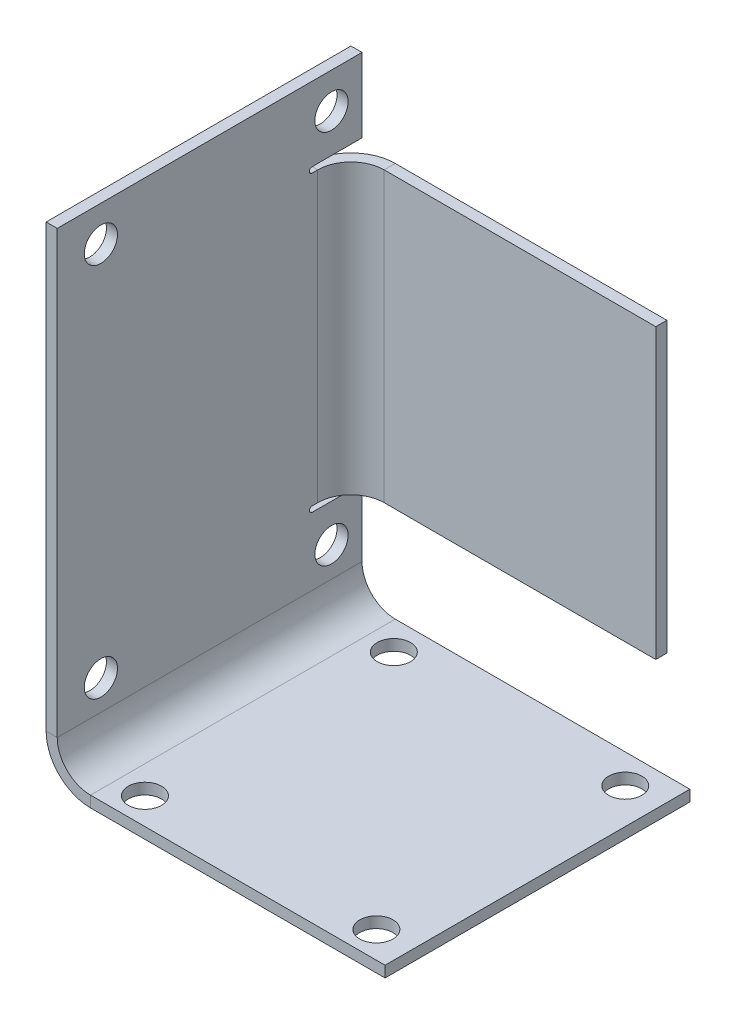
ISO-10303-21;
HEADER;
FILE_DESCRIPTION(('STEP AP214'),'2;1');
FILE_NAME('part.step','',(''),(''),'','','');
FILE_SCHEMA(('AUTOMOTIVE_DESIGN { 1 0 10303 214 1 1 1 1 }'));
ENDSEC;
DATA;
#1=APPLICATION_CONTEXT('core data for automotive mechanical design processes');
#2=APPLICATION_PROTOCOL_DEFINITION('international standard','automotive_design',2000,#1);
#3=PRODUCT_CONTEXT('',#1,'mechanical');
#4=PRODUCT('Part','Part','',(#3));
#5=PRODUCT_RELATED_PRODUCT_CATEGORY('part','',(#4));
#6=PRODUCT_DEFINITION_FORMATION('','',#4);
#7=PRODUCT_DEFINITION_CONTEXT('part definition',#1,'design');
#8=PRODUCT_DEFINITION('design','',#6,#7);
#9=PRODUCT_DEFINITION_SHAPE('','',#8);
#10=(LENGTH_UNIT() NAMED_UNIT(*) SI_UNIT(.MILLI.,.METRE.));
#11=(NAMED_UNIT(*) PLANE_ANGLE_UNIT() SI_UNIT($,.RADIAN.));
#12=(NAMED_UNIT(*) SI_UNIT($,.STERADIAN.) SOLID_ANGLE_UNIT());
#13=UNCERTAINTY_MEASURE_WITH_UNIT(LENGTH_MEASURE(1.E-05),#10,'distance_accuracy_value','');
#14=(GEOMETRIC_REPRESENTATION_CONTEXT(3) GLOBAL_UNCERTAINTY_ASSIGNED_CONTEXT((#13)) GLOBAL_UNIT_ASSIGNED_CONTEXT((#10,
#11,#12)) REPRESENTATION_CONTEXT('',''));
#15=CARTESIAN_POINT('',(0.,0.,0.));
#16=DIRECTION('',(0.,0.,1.));
#17=DIRECTION('',(1.,0.,0.));
#18=AXIS2_PLACEMENT_3D('',#15,#16,#17);
#19=CARTESIAN_POINT('',(0.,85.5607180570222,55.));
#20=DIRECTION('',(1.,0.,0.));
#21=DIRECTION('',(0.,0.,-1.));
#22=AXIS2_PLACEMENT_3D('',#19,#20,#21);
#23=PLANE('',#22);
#24=CARTESIAN_POINT('',(0.,11.3845694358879,47.1202330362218));
#25=DIRECTION('',(1.,0.,0.));
#26=DIRECTION('',(0.,0.,-1.));
#27=AXIS2_PLACEMENT_3D('',#24,#25,#26);
#28=CIRCLE('',#27,3.);
#29=CARTESIAN_POINT('',(0.,11.3845694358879,44.1202330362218));
#30=VERTEX_POINT('',#29);
#31=EDGE_CURVE('E897',#30,#30,#28,.T.);
#32=ORIENTED_EDGE('',*,*,#31,.F.);
#33=EDGE_LOOP('',(#32));
#34=FACE_BOUND('',#33,.T.);
#35=CARTESIAN_POINT('',(0.,79.1522314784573,5.51288170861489));
#36=DIRECTION('',(1.,0.,0.));
#37=DIRECTION('',(0.,0.,-1.));
#38=AXIS2_PLACEMENT_3D('',#35,#36,#37);
#39=CIRCLE('',#38,3.);
#40=CARTESIAN_POINT('',(0.,79.1522314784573,2.51288170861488));
#41=VERTEX_POINT('',#40);
#42=EDGE_CURVE('E237',#41,#41,#39,.T.);
#43=ORIENTED_EDGE('',*,*,#42,.F.);
#44=EDGE_LOOP('',(#43));
#45=FACE_BOUND('',#44,.T.);
#46=DIRECTION('',(0.,0.,-1.));
#47=VECTOR('',#46,1.);
#48=CARTESIAN_POINT('',(0.,19.1920091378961,55.));
#49=LINE('',#48,#47);
#50=CARTESIAN_POINT('',(0.,19.1920091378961,8.99999999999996));
#51=VERTEX_POINT('',#50);
#52=CARTESIAN_POINT('',(0.,19.192009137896,8.));
#53=VERTEX_POINT('',#52);
#54=EDGE_CURVE('E296',#51,#53,#49,.T.);
#55=ORIENTED_EDGE('',*,*,#54,.T.);
#56=DIRECTION('',(0.,1.,0.));
#57=VECTOR('',#56,1.);
#58=CARTESIAN_POINT('',(0.,19.1920091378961,8.));
#59=LINE('',#58,#57);
#60=CARTESIAN_POINT('',(0.,71.2035560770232,8.));
#61=VERTEX_POINT('',#60);
#62=EDGE_CURVE('E304',#53,#61,#59,.T.);
#63=ORIENTED_EDGE('',*,*,#62,.T.);
#64=DIRECTION('',(0.,0.,1.));
#65=VECTOR('',#64,1.);
#66=CARTESIAN_POINT('',(0.,71.2035560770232,55.));
#67=LINE('',#66,#65);
#68=CARTESIAN_POINT('',(0.,71.2035560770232,8.99999999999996));
#69=VERTEX_POINT('',#68);
#70=EDGE_CURVE('E299',#61,#69,#67,.T.);
#71=ORIENTED_EDGE('',*,*,#70,.T.);
#72=CARTESIAN_POINT('',(0.,71.7035560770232,8.99999999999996));
#73=DIRECTION('',(1.,0.,0.));
#74=DIRECTION('',(0.,0.,-1.));
#75=AXIS2_PLACEMENT_3D('',#72,#73,#74);
#76=CIRCLE('',#75,0.5);
#77=CARTESIAN_POINT('',(0.,72.2035560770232,8.99999999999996));
#78=VERTEX_POINT('',#77);
#79=EDGE_CURVE('E276',#78,#69,#76,.T.);
#80=ORIENTED_EDGE('',*,*,#79,.F.);
#81=DIRECTION('',(0.,0.,-1.));
#82=VECTOR('',#81,1.);
#83=CARTESIAN_POINT('',(0.,72.2035560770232,55.));
#84=LINE('',#83,#82);
#85=CARTESIAN_POINT('',(0.,72.2035560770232,0.));
#86=VERTEX_POINT('',#85);
#87=EDGE_CURVE('E279',#78,#86,#84,.T.);
#88=ORIENTED_EDGE('',*,*,#87,.T.);
#89=DIRECTION('',(0.,-1.,0.));
#90=VECTOR('',#89,1.);
#91=CARTESIAN_POINT('',(0.,85.5607180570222,0.));
#92=LINE('',#91,#90);
#93=CARTESIAN_POINT('',(0.,85.5607180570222,0.));
#94=VERTEX_POINT('',#93);
#95=EDGE_CURVE('E281',#94,#86,#92,.T.);
#96=ORIENTED_EDGE('',*,*,#95,.F.);
#97=DIRECTION('',(0.,0.,-1.));
#98=VECTOR('',#97,1.);
#99=CARTESIAN_POINT('',(0.,85.5607180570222,55.));
#100=LINE('',#99,#98);
#101=CARTESIAN_POINT('',(0.,85.5607180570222,55.));
#102=VERTEX_POINT('',#101);
#103=EDGE_CURVE('E284',#102,#94,#100,.T.);
#104=ORIENTED_EDGE('',*,*,#103,.F.);
#105=DIRECTION('',(0.,-1.,0.));
#106=VECTOR('',#105,1.);
#107=CARTESIAN_POINT('',(0.,85.5607180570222,55.));
#108=LINE('',#107,#106);
#109=CARTESIAN_POINT('',(0.,6.00000000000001,55.));
#110=VERTEX_POINT('',#109);
#111=EDGE_CURVE('E288',#102,#110,#108,.T.);
#112=ORIENTED_EDGE('',*,*,#111,.T.);
#113=DIRECTION('',(0.,0.,-1.));
#114=VECTOR('',#113,1.);
#115=CARTESIAN_POINT('',(0.,6.,55.));
#116=LINE('',#115,#114);
#117=CARTESIAN_POINT('',(0.,6.,0.));
#118=VERTEX_POINT('',#117);
#119=EDGE_CURVE('E301',#110,#118,#116,.T.);
#120=ORIENTED_EDGE('',*,*,#119,.T.);
#121=CARTESIAN_POINT('',(0.,18.1920091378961,0.));
#122=VERTEX_POINT('',#121);
#123=EDGE_CURVE('E285',#122,#118,#92,.T.);
#124=ORIENTED_EDGE('',*,*,#123,.F.);
#125=DIRECTION('',(0.,0.,1.));
#126=VECTOR('',#125,1.);
#127=CARTESIAN_POINT('',(0.,18.1920091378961,55.));
#128=LINE('',#127,#126);
#129=CARTESIAN_POINT('',(0.,18.1920091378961,8.99999999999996));
#130=VERTEX_POINT('',#129);
#131=EDGE_CURVE('E291',#122,#130,#128,.T.);
#132=ORIENTED_EDGE('',*,*,#131,.T.);
#133=CARTESIAN_POINT('',(0.,18.6920091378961,8.99999999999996));
#134=DIRECTION('',(1.,0.,0.));
#135=DIRECTION('',(0.,0.,-1.));
#136=AXIS2_PLACEMENT_3D('',#133,#134,#135);
#137=CIRCLE('',#136,0.5);
#138=EDGE_CURVE('E293',#51,#130,#137,.T.);
#139=ORIENTED_EDGE('',*,*,#138,.F.);
#140=EDGE_LOOP('',(#55,#63,#71,#80,#88,#96,#104,#112,#120,#124,#132,#139));
#141=FACE_BOUND('',#140,.T.);
#142=CARTESIAN_POINT('',(0.,79.1522314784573,47.1202330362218));
#143=DIRECTION('',(1.,0.,0.));
#144=DIRECTION('',(0.,0.,-1.));
#145=AXIS2_PLACEMENT_3D('',#142,#143,#144);
#146=CIRCLE('',#145,3.);
#147=CARTESIAN_POINT('',(0.,79.1522314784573,44.1202330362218));
#148=VERTEX_POINT('',#147);
#149=EDGE_CURVE('E902',#148,#148,#146,.T.);
#150=ORIENTED_EDGE('',*,*,#149,.F.);
#151=EDGE_LOOP('',(#150));
#152=FACE_BOUND('',#151,.T.);
#153=CARTESIAN_POINT('',(0.,11.3845694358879,5.51288170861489));
#154=DIRECTION('',(1.,0.,0.));
#155=DIRECTION('',(0.,0.,-1.));
#156=AXIS2_PLACEMENT_3D('',#153,#154,#155);
#157=CIRCLE('',#156,3.);
#158=CARTESIAN_POINT('',(0.,11.3845694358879,2.51288170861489));
#159=VERTEX_POINT('',#158);
#160=EDGE_CURVE('E886',#159,#159,#157,.T.);
#161=ORIENTED_EDGE('',*,*,#160,.F.);
#162=EDGE_LOOP('',(#161));
#163=FACE_BOUND('',#162,.T.);
#164=ADVANCED_FACE('F32',(#34,#45,#141,#152,#163),#23,.T.);
#165=CARTESIAN_POINT('',(-2.,85.5607180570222,55.));
#166=DIRECTION('',(1.,0.,0.));
#167=DIRECTION('',(0.,0.,-1.));
#168=AXIS2_PLACEMENT_3D('',#165,#166,#167);
#169=PLANE('',#168);
#170=CARTESIAN_POINT('',(-2.,11.3845694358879,47.1202330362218));
#171=DIRECTION('',(1.,0.,0.));
#172=DIRECTION('',(0.,0.,-1.));
#173=AXIS2_PLACEMENT_3D('',#170,#171,#172);
#174=CIRCLE('',#173,3.);
#175=CARTESIAN_POINT('',(-2.,11.3845694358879,44.1202330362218));
#176=VERTEX_POINT('',#175);
#177=EDGE_CURVE('E899',#176,#176,#174,.T.);
#178=ORIENTED_EDGE('',*,*,#177,.T.);
#179=EDGE_LOOP('',(#178));
#180=FACE_BOUND('',#179,.T.);
#181=CARTESIAN_POINT('',(-2.,79.1522314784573,5.51288170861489));
#182=DIRECTION('',(1.,0.,0.));
#183=DIRECTION('',(0.,0.,-1.));
#184=AXIS2_PLACEMENT_3D('',#181,#182,#183);
#185=CIRCLE('',#184,3.);
#186=CARTESIAN_POINT('',(-2.,79.1522314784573,2.51288170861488));
#187=VERTEX_POINT('',#186);
#188=EDGE_CURVE('E240',#187,#187,#185,.T.);
#189=ORIENTED_EDGE('',*,*,#188,.T.);
#190=EDGE_LOOP('',(#189));
#191=FACE_BOUND('',#190,.T.);
#192=DIRECTION('',(0.,1.,0.));
#193=VECTOR('',#192,1.);
#194=CARTESIAN_POINT('',(-2.,19.1920091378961,8.));
#195=LINE('',#194,#193);
#196=CARTESIAN_POINT('',(-2.,19.192009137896,8.));
#197=VERTEX_POINT('',#196);
#198=CARTESIAN_POINT('',(-2.,71.2035560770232,8.));
#199=VERTEX_POINT('',#198);
#200=EDGE_CURVE('E274',#197,#199,#195,.T.);
#201=ORIENTED_EDGE('',*,*,#200,.F.);
#202=DIRECTION('',(0.,0.,-1.));
#203=VECTOR('',#202,1.);
#204=CARTESIAN_POINT('',(-2.,19.1920091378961,55.));
#205=LINE('',#204,#203);
#206=CARTESIAN_POINT('',(-2.,19.1920091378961,8.99999999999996));
#207=VERTEX_POINT('',#206);
#208=EDGE_CURVE('E254',#207,#197,#205,.T.);
#209=ORIENTED_EDGE('',*,*,#208,.F.);
#210=CARTESIAN_POINT('',(-2.,18.6920091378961,8.99999999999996));
#211=DIRECTION('',(1.,0.,0.));
#212=DIRECTION('',(0.,0.,-1.));
#213=AXIS2_PLACEMENT_3D('',#210,#211,#212);
#214=CIRCLE('',#213,0.5);
#215=CARTESIAN_POINT('',(-2.,18.1920091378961,8.99999999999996));
#216=VERTEX_POINT('',#215);
#217=EDGE_CURVE('E262',#207,#216,#214,.T.);
#218=ORIENTED_EDGE('',*,*,#217,.T.);
#219=DIRECTION('',(0.,0.,1.));
#220=VECTOR('',#219,1.);
#221=CARTESIAN_POINT('',(-2.,18.1920091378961,55.));
#222=LINE('',#221,#220);
#223=CARTESIAN_POINT('',(-2.,18.1920091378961,0.));
#224=VERTEX_POINT('',#223);
#225=EDGE_CURVE('E265',#224,#216,#222,.T.);
#226=ORIENTED_EDGE('',*,*,#225,.F.);
#227=DIRECTION('',(0.,1.,0.));
#228=VECTOR('',#227,1.);
#229=CARTESIAN_POINT('',(-2.,85.5607180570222,0.));
#230=LINE('',#229,#228);
#231=CARTESIAN_POINT('',(-2.,6.00000000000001,0.));
#232=VERTEX_POINT('',#231);
#233=EDGE_CURVE('E260',#224,#232,#230,.F.);
#234=ORIENTED_EDGE('',*,*,#233,.T.);
#235=DIRECTION('',(0.,0.,-1.));
#236=VECTOR('',#235,1.);
#237=CARTESIAN_POINT('',(-2.,6.,55.));
#238=LINE('',#237,#236);
#239=CARTESIAN_POINT('',(-2.,6.00000000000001,55.));
#240=VERTEX_POINT('',#239);
#241=EDGE_CURVE('E258',#240,#232,#238,.T.);
#242=ORIENTED_EDGE('',*,*,#241,.F.);
#243=DIRECTION('',(0.,1.,0.));
#244=VECTOR('',#243,1.);
#245=CARTESIAN_POINT('',(-2.,85.5607180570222,55.));
#246=LINE('',#245,#244);
#247=CARTESIAN_POINT('',(-2.,85.5607180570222,55.));
#248=VERTEX_POINT('',#247);
#249=EDGE_CURVE('E268',#248,#240,#246,.F.);
#250=ORIENTED_EDGE('',*,*,#249,.F.);
#251=DIRECTION('',(0.,0.,-1.));
#252=VECTOR('',#251,1.);
#253=CARTESIAN_POINT('',(-2.,85.5607180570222,55.));
#254=LINE('',#253,#252);
#255=CARTESIAN_POINT('',(-2.,85.5607180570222,0.));
#256=VERTEX_POINT('',#255);
#257=EDGE_CURVE('E259',#248,#256,#254,.T.);
#258=ORIENTED_EDGE('',*,*,#257,.T.);
#259=CARTESIAN_POINT('',(-2.,72.2035560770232,0.));
#260=VERTEX_POINT('',#259);
#261=EDGE_CURVE('E255',#256,#260,#230,.F.);
#262=ORIENTED_EDGE('',*,*,#261,.T.);
#263=DIRECTION('',(0.,0.,-1.));
#264=VECTOR('',#263,1.);
#265=CARTESIAN_POINT('',(-2.,72.2035560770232,55.));
#266=LINE('',#265,#264);
#267=CARTESIAN_POINT('',(-2.,72.2035560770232,8.99999999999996));
#268=VERTEX_POINT('',#267);
#269=EDGE_CURVE('E247',#268,#260,#266,.T.);
#270=ORIENTED_EDGE('',*,*,#269,.F.);
#271=CARTESIAN_POINT('',(-2.,71.7035560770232,8.99999999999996));
#272=DIRECTION('',(1.,0.,0.));
#273=DIRECTION('',(0.,0.,-1.));
#274=AXIS2_PLACEMENT_3D('',#271,#272,#273);
#275=CIRCLE('',#274,0.5);
#276=CARTESIAN_POINT('',(-2.,71.2035560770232,8.99999999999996));
#277=VERTEX_POINT('',#276);
#278=EDGE_CURVE('E115',#268,#277,#275,.T.);
#279=ORIENTED_EDGE('',*,*,#278,.T.);
#280=DIRECTION('',(0.,0.,1.));
#281=VECTOR('',#280,1.);
#282=CARTESIAN_POINT('',(-2.,71.2035560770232,55.));
#283=LINE('',#282,#281);
#284=EDGE_CURVE('E108',#199,#277,#283,.T.);
#285=ORIENTED_EDGE('',*,*,#284,.F.);
#286=EDGE_LOOP('',(#201,#209,#218,#226,#234,#242,#250,#258,#262,#270,#279,#285));
#287=FACE_BOUND('',#286,.T.);
#288=CARTESIAN_POINT('',(-2.,79.1522314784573,47.1202330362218));
#289=DIRECTION('',(1.,0.,0.));
#290=DIRECTION('',(0.,0.,-1.));
#291=AXIS2_PLACEMENT_3D('',#288,#289,#290);
#292=CIRCLE('',#291,3.);
#293=CARTESIAN_POINT('',(-2.,79.1522314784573,44.1202330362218));
#294=VERTEX_POINT('',#293);
#295=EDGE_CURVE('E905',#294,#294,#292,.T.);
#296=ORIENTED_EDGE('',*,*,#295,.T.);
#297=EDGE_LOOP('',(#296));
#298=FACE_BOUND('',#297,.T.);
#299=CARTESIAN_POINT('',(-2.,11.3845694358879,5.51288170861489));
#300=DIRECTION('',(1.,0.,0.));
#301=DIRECTION('',(0.,0.,-1.));
#302=AXIS2_PLACEMENT_3D('',#299,#300,#301);
#303=CIRCLE('',#302,3.);
#304=CARTESIAN_POINT('',(-2.,11.3845694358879,2.51288170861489));
#305=VERTEX_POINT('',#304);
#306=EDGE_CURVE('E890',#305,#305,#303,.T.);
#307=ORIENTED_EDGE('',*,*,#306,.T.);
#308=EDGE_LOOP('',(#307));
#309=FACE_BOUND('',#308,.T.);
#310=ADVANCED_FACE('F391',(#180,#191,#287,#298,#309),#169,.F.);
#311=CARTESIAN_POINT('',(55.,71.2035560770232,144.915373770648));
#312=DIRECTION('',(1.,0.,0.));
#313=DIRECTION('',(0.,0.,-1.));
#314=AXIS2_PLACEMENT_3D('',#311,#312,#313);
#315=PLANE('',#314);
#316=DIRECTION('',(0.,0.,-1.));
#317=VECTOR('',#316,1.);
#318=CARTESIAN_POINT('',(55.,19.1920091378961,144.915373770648));
#319=LINE('',#318,#317);
#320=CARTESIAN_POINT('',(55.,19.1920091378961,2.));
#321=VERTEX_POINT('',#320);
#322=CARTESIAN_POINT('',(55.,19.1920091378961,0.));
#323=VERTEX_POINT('',#322);
#324=EDGE_CURVE('E225',#321,#323,#319,.T.);
#325=ORIENTED_EDGE('',*,*,#324,.T.);
#326=DIRECTION('',(0.,-1.,0.));
#327=VECTOR('',#326,1.);
#328=CARTESIAN_POINT('',(55.,71.2035560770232,0.));
#329=LINE('',#328,#327);
#330=CARTESIAN_POINT('',(55.,71.2035560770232,0.));
#331=VERTEX_POINT('',#330);
#332=EDGE_CURVE('E203',#331,#323,#329,.T.);
#333=ORIENTED_EDGE('',*,*,#332,.F.);
#334=DIRECTION('',(0.,0.,-1.));
#335=VECTOR('',#334,1.);
#336=CARTESIAN_POINT('',(55.,71.2035560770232,144.915373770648));
#337=LINE('',#336,#335);
#338=CARTESIAN_POINT('',(55.,71.2035560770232,2.));
#339=VERTEX_POINT('',#338);
#340=EDGE_CURVE('E362',#339,#331,#337,.T.);
#341=ORIENTED_EDGE('',*,*,#340,.F.);
#342=DIRECTION('',(0.,1.,0.));
#343=VECTOR('',#342,1.);
#344=CARTESIAN_POINT('',(55.,71.2035560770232,2.));
#345=LINE('',#344,#343);
#346=EDGE_CURVE('E51',#339,#321,#345,.F.);
#347=ORIENTED_EDGE('',*,*,#346,.T.);
#348=EDGE_LOOP('',(#325,#333,#341,#347));
#349=FACE_BOUND('',#348,.T.);
#350=ADVANCED_FACE('F369',(#349),#315,.T.);
#351=CARTESIAN_POINT('',(55.,19.1920091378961,144.915373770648));
#352=DIRECTION('',(0.,-1.,0.));
#353=DIRECTION('',(1.,0.,0.));
#354=AXIS2_PLACEMENT_3D('',#351,#352,#353);
#355=PLANE('',#354);
#356=DIRECTION('',(0.,0.,-1.));
#357=VECTOR('',#356,1.);
#358=CARTESIAN_POINT('',(6.,19.1920091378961,144.915373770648));
#359=LINE('',#358,#357);
#360=CARTESIAN_POINT('',(5.99999999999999,19.1920091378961,2.));
#361=VERTEX_POINT('',#360);
#362=CARTESIAN_POINT('',(6.,19.192009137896,0.));
#363=VERTEX_POINT('',#362);
#364=EDGE_CURVE('E210',#361,#363,#359,.T.);
#365=ORIENTED_EDGE('',*,*,#364,.T.);
#366=DIRECTION('',(-1.,0.,0.));
#367=VECTOR('',#366,1.);
#368=CARTESIAN_POINT('',(55.,19.1920091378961,0.));
#369=LINE('',#368,#367);
#370=EDGE_CURVE('E195',#323,#363,#369,.T.);
#371=ORIENTED_EDGE('',*,*,#370,.F.);
#372=ORIENTED_EDGE('',*,*,#324,.F.);
#373=DIRECTION('',(-1.,0.,0.));
#374=VECTOR('',#373,1.);
#375=CARTESIAN_POINT('',(55.,19.1920091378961,2.));
#376=LINE('',#375,#374);
#377=EDGE_CURVE('E212',#321,#361,#376,.T.);
#378=ORIENTED_EDGE('',*,*,#377,.T.);
#379=EDGE_LOOP('',(#365,#371,#372,#378));
#380=FACE_BOUND('',#379,.T.);
#381=ADVANCED_FACE('F211',(#380),#355,.T.);
#382=CARTESIAN_POINT('',(59.1549102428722,-2.,0.));
#383=DIRECTION('',(0.,0.,-1.));
#384=DIRECTION('',(-1.,0.,0.));
#385=AXIS2_PLACEMENT_3D('',#382,#383,#384);
#386=PLANE('',#385);
#387=DIRECTION('',(0.,-1.,0.));
#388=VECTOR('',#387,1.);
#389=CARTESIAN_POINT('',(6.,19.1920091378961,0.));
#390=LINE('',#389,#388);
#391=CARTESIAN_POINT('',(6.,71.2035560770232,0.));
#392=VERTEX_POINT('',#391);
#393=EDGE_CURVE('E200',#392,#363,#390,.T.);
#394=ORIENTED_EDGE('',*,*,#393,.F.);
#395=DIRECTION('',(-1.,0.,0.));
#396=VECTOR('',#395,1.);
#397=CARTESIAN_POINT('',(55.,71.2035560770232,0.));
#398=LINE('',#397,#396);
#399=EDGE_CURVE('E207',#331,#392,#398,.T.);
#400=ORIENTED_EDGE('',*,*,#399,.F.);
#401=ORIENTED_EDGE('',*,*,#332,.T.);
#402=ORIENTED_EDGE('',*,*,#370,.T.);
#403=EDGE_LOOP('',(#394,#400,#401,#402));
#404=FACE_BOUND('',#403,.T.);
#405=ADVANCED_FACE('F197',(#404),#386,.T.);
#406=CARTESIAN_POINT('',(55.,71.2035560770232,144.915373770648));
#407=DIRECTION('',(0.,-1.,0.));
#408=DIRECTION('',(1.,0.,0.));
#409=AXIS2_PLACEMENT_3D('',#406,#407,#408);
#410=PLANE('',#409);
#411=ORIENTED_EDGE('',*,*,#399,.T.);
#412=DIRECTION('',(0.,0.,-1.));
#413=VECTOR('',#412,1.);
#414=CARTESIAN_POINT('',(6.,71.2035560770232,144.915373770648));
#415=LINE('',#414,#413);
#416=CARTESIAN_POINT('',(6.,71.2035560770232,2.));
#417=VERTEX_POINT('',#416);
#418=EDGE_CURVE('E36',#417,#392,#415,.T.);
#419=ORIENTED_EDGE('',*,*,#418,.F.);
#420=DIRECTION('',(-1.,0.,0.));
#421=VECTOR('',#420,1.);
#422=CARTESIAN_POINT('',(55.,71.2035560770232,2.));
#423=LINE('',#422,#421);
#424=EDGE_CURVE('E42',#339,#417,#423,.T.);
#425=ORIENTED_EDGE('',*,*,#424,.F.);
#426=ORIENTED_EDGE('',*,*,#340,.T.);
#427=EDGE_LOOP('',(#411,#419,#425,#426));
#428=FACE_BOUND('',#427,.T.);
#429=ADVANCED_FACE('F372',(#428),#410,.F.);
#430=CARTESIAN_POINT('',(55.,71.2035560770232,2.));
#431=DIRECTION('',(0.,0.,-1.));
#432=DIRECTION('',(-1.,0.,0.));
#433=AXIS2_PLACEMENT_3D('',#430,#431,#432);
#434=PLANE('',#433);
#435=ORIENTED_EDGE('',*,*,#424,.T.);
#436=DIRECTION('',(0.,-1.,0.));
#437=VECTOR('',#436,1.);
#438=CARTESIAN_POINT('',(6.,19.1920091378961,2.));
#439=LINE('',#438,#437);
#440=EDGE_CURVE('E11',#417,#361,#439,.T.);
#441=ORIENTED_EDGE('',*,*,#440,.T.);
#442=ORIENTED_EDGE('',*,*,#377,.F.);
#443=ORIENTED_EDGE('',*,*,#346,.F.);
#444=EDGE_LOOP('',(#435,#441,#442,#443));
#445=FACE_BOUND('',#444,.T.);
#446=ADVANCED_FACE('F34',(#445),#434,.F.);
#447=CARTESIAN_POINT('',(59.1549102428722,152.976396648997,55.));
#448=DIRECTION('',(-1.,0.,0.));
#449=DIRECTION('',(0.,-1.,0.));
#450=AXIS2_PLACEMENT_3D('',#447,#448,#449);
#451=PLANE('',#450);
#452=DIRECTION('',(0.,-1.,0.));
#453=VECTOR('',#452,1.);
#454=CARTESIAN_POINT('',(59.1549102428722,152.976396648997,55.));
#455=LINE('',#454,#453);
#456=CARTESIAN_POINT('',(59.1549102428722,0.,55.));
#457=VERTEX_POINT('',#456);
#458=CARTESIAN_POINT('',(59.1549102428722,-2.,55.));
#459=VERTEX_POINT('',#458);
#460=EDGE_CURVE('E356',#457,#459,#455,.T.);
#461=ORIENTED_EDGE('',*,*,#460,.T.);
#462=DIRECTION('',(0.,0.,-1.));
#463=VECTOR('',#462,1.);
#464=CARTESIAN_POINT('',(59.1549102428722,-2.,55.));
#465=LINE('',#464,#463);
#466=CARTESIAN_POINT('',(59.1549102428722,-2.,0.));
#467=VERTEX_POINT('',#466);
#468=EDGE_CURVE('E353',#459,#467,#465,.T.);
#469=ORIENTED_EDGE('',*,*,#468,.T.);
#470=DIRECTION('',(0.,-1.,0.));
#471=VECTOR('',#470,1.);
#472=CARTESIAN_POINT('',(59.1549102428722,152.976396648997,0.));
#473=LINE('',#472,#471);
#474=CARTESIAN_POINT('',(59.1549102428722,0.,0.));
#475=VERTEX_POINT('',#474);
#476=EDGE_CURVE('E340',#475,#467,#473,.T.);
#477=ORIENTED_EDGE('',*,*,#476,.F.);
#478=DIRECTION('',(0.,0.,-1.));
#479=VECTOR('',#478,1.);
#480=CARTESIAN_POINT('',(59.1549102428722,0.,55.));
#481=LINE('',#480,#479);
#482=EDGE_CURVE('E78',#457,#475,#481,.T.);
#483=ORIENTED_EDGE('',*,*,#482,.F.);
#484=EDGE_LOOP('',(#461,#469,#477,#483));
#485=FACE_BOUND('',#484,.T.);
#486=ADVANCED_FACE('F420',(#485),#451,.F.);
#487=CARTESIAN_POINT('',(0.,152.976396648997,55.));
#488=DIRECTION('',(0.,0.,-1.));
#489=DIRECTION('',(0.,-1.,0.));
#490=AXIS2_PLACEMENT_3D('',#487,#488,#489);
#491=PLANE('',#490);
#492=DIRECTION('',(0.,-1.,0.));
#493=VECTOR('',#492,1.);
#494=CARTESIAN_POINT('',(6.,152.976396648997,55.));
#495=LINE('',#494,#493);
#496=CARTESIAN_POINT('',(6.,0.,55.));
#497=VERTEX_POINT('',#496);
#498=CARTESIAN_POINT('',(5.99999999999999,-2.,55.));
#499=VERTEX_POINT('',#498);
#500=EDGE_CURVE('E351',#497,#499,#495,.T.);
#501=ORIENTED_EDGE('',*,*,#500,.T.);
#502=DIRECTION('',(1.,0.,0.));
#503=VECTOR('',#502,1.);
#504=CARTESIAN_POINT('',(0.,-2.,55.));
#505=LINE('',#504,#503);
#506=EDGE_CURVE('E100',#499,#459,#505,.T.);
#507=ORIENTED_EDGE('',*,*,#506,.T.);
#508=ORIENTED_EDGE('',*,*,#460,.F.);
#509=DIRECTION('',(1.,0.,0.));
#510=VECTOR('',#509,1.);
#511=CARTESIAN_POINT('',(0.,0.,55.));
#512=LINE('',#511,#510);
#513=EDGE_CURVE('E338',#497,#457,#512,.T.);
#514=ORIENTED_EDGE('',*,*,#513,.F.);
#515=EDGE_LOOP('',(#501,#507,#508,#514));
#516=FACE_BOUND('',#515,.T.);
#517=ADVANCED_FACE('F422',(#516),#491,.F.);
#518=CARTESIAN_POINT('',(0.,-2.,55.));
#519=DIRECTION('',(0.,1.,0.));
#520=DIRECTION('',(0.,0.,1.));
#521=AXIS2_PLACEMENT_3D('',#518,#519,#520);
#522=PLANE('',#521);
#523=CARTESIAN_POINT('',(52.775282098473,-2.,50.1902691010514));
#524=DIRECTION('',(0.,1.,0.));
#525=DIRECTION('',(0.,0.,1.));
#526=AXIS2_PLACEMENT_3D('',#523,#524,#525);
#527=CIRCLE('',#526,3.);
#528=CARTESIAN_POINT('',(52.775282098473,-2.,53.1902691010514));
#529=VERTEX_POINT('',#528);
#530=EDGE_CURVE('E873',#529,#529,#527,.T.);
#531=ORIENTED_EDGE('',*,*,#530,.T.);
#532=EDGE_LOOP('',(#531));
#533=FACE_BOUND('',#532,.T.);
#534=CARTESIAN_POINT('',(11.0156734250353,-2.,50.1902691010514));
#535=DIRECTION('',(0.,1.,0.));
#536=DIRECTION('',(0.,0.,1.));
#537=AXIS2_PLACEMENT_3D('',#534,#535,#536);
#538=CIRCLE('',#537,3.);
#539=CARTESIAN_POINT('',(11.0156734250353,-2.,53.1902691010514));
#540=VERTEX_POINT('',#539);
#541=EDGE_CURVE('E877',#540,#540,#538,.T.);
#542=ORIENTED_EDGE('',*,*,#541,.T.);
#543=EDGE_LOOP('',(#542));
#544=FACE_BOUND('',#543,.T.);
#545=CARTESIAN_POINT('',(11.0156734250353,-2.,5.2794131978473));
#546=DIRECTION('',(0.,1.,0.));
#547=DIRECTION('',(0.,0.,1.));
#548=AXIS2_PLACEMENT_3D('',#545,#546,#547);
#549=CIRCLE('',#548,3.);
#550=CARTESIAN_POINT('',(11.0156734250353,-2.,8.2794131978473));
#551=VERTEX_POINT('',#550);
#552=EDGE_CURVE('E881',#551,#551,#549,.T.);
#553=ORIENTED_EDGE('',*,*,#552,.T.);
#554=EDGE_LOOP('',(#553));
#555=FACE_BOUND('',#554,.T.);
#556=CARTESIAN_POINT('',(52.775282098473,-2.,5.2794131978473));
#557=DIRECTION('',(0.,1.,0.));
#558=DIRECTION('',(0.,0.,1.));
#559=AXIS2_PLACEMENT_3D('',#556,#557,#558);
#560=CIRCLE('',#559,3.);
#561=CARTESIAN_POINT('',(52.775282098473,-2.,8.27941319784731));
#562=VERTEX_POINT('',#561);
#563=EDGE_CURVE('E884',#562,#562,#560,.T.);
#564=ORIENTED_EDGE('',*,*,#563,.T.);
#565=EDGE_LOOP('',(#564));
#566=FACE_BOUND('',#565,.T.);
#567=ORIENTED_EDGE('',*,*,#506,.F.);
#568=DIRECTION('',(0.,0.,-1.));
#569=VECTOR('',#568,1.);
#570=CARTESIAN_POINT('',(6.,-2.,55.));
#571=LINE('',#570,#569);
#572=CARTESIAN_POINT('',(6.,-2.,0.));
#573=VERTEX_POINT('',#572);
#574=EDGE_CURVE('E347',#499,#573,#571,.T.);
#575=ORIENTED_EDGE('',*,*,#574,.T.);
#576=DIRECTION('',(1.,0.,0.));
#577=VECTOR('',#576,1.);
#578=CARTESIAN_POINT('',(0.,-2.,0.));
#579=LINE('',#578,#577);
#580=EDGE_CURVE('E344',#573,#467,#579,.T.);
#581=ORIENTED_EDGE('',*,*,#580,.T.);
#582=ORIENTED_EDGE('',*,*,#468,.F.);
#583=EDGE_LOOP('',(#567,#575,#581,#582));
#584=FACE_BOUND('',#583,.T.);
#585=ADVANCED_FACE('F413',(#533,#544,#555,#566,#584),#522,.F.);
#586=CARTESIAN_POINT('',(0.,152.976396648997,0.));
#587=DIRECTION('',(0.,0.,-1.));
#588=DIRECTION('',(0.,-1.,0.));
#589=AXIS2_PLACEMENT_3D('',#586,#587,#588);
#590=PLANE('',#589);
#591=ORIENTED_EDGE('',*,*,#580,.F.);
#592=DIRECTION('',(0.,-1.,0.));
#593=VECTOR('',#592,1.);
#594=CARTESIAN_POINT('',(6.,152.976396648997,0.));
#595=LINE('',#594,#593);
#596=CARTESIAN_POINT('',(6.,0.,0.));
#597=VERTEX_POINT('',#596);
#598=EDGE_CURVE('E358',#597,#573,#595,.T.);
#599=ORIENTED_EDGE('',*,*,#598,.F.);
#600=DIRECTION('',(1.,0.,0.));
#601=VECTOR('',#600,1.);
#602=CARTESIAN_POINT('',(0.,0.,0.));
#603=LINE('',#602,#601);
#604=EDGE_CURVE('E342',#597,#475,#603,.T.);
#605=ORIENTED_EDGE('',*,*,#604,.T.);
#606=ORIENTED_EDGE('',*,*,#476,.T.);
#607=EDGE_LOOP('',(#591,#599,#605,#606));
#608=FACE_BOUND('',#607,.T.);
#609=ADVANCED_FACE('F417',(#608),#590,.T.);
#610=CARTESIAN_POINT('',(0.,0.,55.));
#611=DIRECTION('',(0.,1.,0.));
#612=DIRECTION('',(0.,0.,1.));
#613=AXIS2_PLACEMENT_3D('',#610,#611,#612);
#614=PLANE('',#613);
#615=CARTESIAN_POINT('',(52.775282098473,0.,50.1902691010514));
#616=DIRECTION('',(0.,1.,0.));
#617=DIRECTION('',(0.,0.,1.));
#618=AXIS2_PLACEMENT_3D('',#615,#616,#617);
#619=CIRCLE('',#618,3.);
#620=CARTESIAN_POINT('',(52.775282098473,0.,53.1902691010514));
#621=VERTEX_POINT('',#620);
#622=EDGE_CURVE('E934',#621,#621,#619,.T.);
#623=ORIENTED_EDGE('',*,*,#622,.F.);
#624=EDGE_LOOP('',(#623));
#625=FACE_BOUND('',#624,.T.);
#626=CARTESIAN_POINT('',(11.0156734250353,0.,50.1902691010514));
#627=DIRECTION('',(0.,1.,0.));
#628=DIRECTION('',(0.,0.,1.));
#629=AXIS2_PLACEMENT_3D('',#626,#627,#628);
#630=CIRCLE('',#629,3.);
#631=CARTESIAN_POINT('',(11.0156734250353,0.,53.1902691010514));
#632=VERTEX_POINT('',#631);
#633=EDGE_CURVE('E930',#632,#632,#630,.T.);
#634=ORIENTED_EDGE('',*,*,#633,.F.);
#635=EDGE_LOOP('',(#634));
#636=FACE_BOUND('',#635,.T.);
#637=CARTESIAN_POINT('',(11.0156734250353,0.,5.2794131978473));
#638=DIRECTION('',(0.,1.,0.));
#639=DIRECTION('',(0.,0.,1.));
#640=AXIS2_PLACEMENT_3D('',#637,#638,#639);
#641=CIRCLE('',#640,3.);
#642=CARTESIAN_POINT('',(11.0156734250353,0.,8.2794131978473));
#643=VERTEX_POINT('',#642);
#644=EDGE_CURVE('E926',#643,#643,#641,.T.);
#645=ORIENTED_EDGE('',*,*,#644,.F.);
#646=EDGE_LOOP('',(#645));
#647=FACE_BOUND('',#646,.T.);
#648=CARTESIAN_POINT('',(52.775282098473,0.,5.2794131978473));
#649=DIRECTION('',(0.,1.,0.));
#650=DIRECTION('',(0.,0.,1.));
#651=AXIS2_PLACEMENT_3D('',#648,#649,#650);
#652=CIRCLE('',#651,3.);
#653=CARTESIAN_POINT('',(52.775282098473,0.,8.27941319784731));
#654=VERTEX_POINT('',#653);
#655=EDGE_CURVE('E887',#654,#654,#652,.T.);
#656=ORIENTED_EDGE('',*,*,#655,.F.);
#657=EDGE_LOOP('',(#656));
#658=FACE_BOUND('',#657,.T.);
#659=DIRECTION('',(0.,0.,-1.));
#660=VECTOR('',#659,1.);
#661=CARTESIAN_POINT('',(6.,0.,55.));
#662=LINE('',#661,#660);
#663=EDGE_CURVE('E336',#497,#597,#662,.T.);
#664=ORIENTED_EDGE('',*,*,#663,.F.);
#665=ORIENTED_EDGE('',*,*,#513,.T.);
#666=ORIENTED_EDGE('',*,*,#482,.T.);
#667=ORIENTED_EDGE('',*,*,#604,.F.);
#668=EDGE_LOOP('',(#664,#665,#666,#667));
#669=FACE_BOUND('',#668,.T.);
#670=ADVANCED_FACE('F424',(#625,#636,#647,#658,#669),#614,.T.);
#671=CARTESIAN_POINT('',(193.441545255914,19.1920091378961,55.));
#672=DIRECTION('',(0.,1.,0.));
#673=DIRECTION('',(0.,0.,1.));
#674=AXIS2_PLACEMENT_3D('',#671,#672,#673);
#675=PLANE('',#674);
#676=DIRECTION('',(-1.,0.,0.));
#677=VECTOR('',#676,1.);
#678=CARTESIAN_POINT('',(193.441545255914,19.1920091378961,8.99999999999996));
#679=LINE('',#678,#677);
#680=EDGE_CURVE('E307',#51,#207,#679,.T.);
#681=ORIENTED_EDGE('',*,*,#680,.T.);
#682=ORIENTED_EDGE('',*,*,#208,.T.);
#683=DIRECTION('',(-1.,0.,0.));
#684=VECTOR('',#683,1.);
#685=CARTESIAN_POINT('',(193.441545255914,19.1920091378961,8.));
#686=LINE('',#685,#684);
#687=EDGE_CURVE('E228',#53,#197,#686,.T.);
#688=ORIENTED_EDGE('',*,*,#687,.F.);
#689=ORIENTED_EDGE('',*,*,#54,.F.);
#690=EDGE_LOOP('',(#681,#682,#688,#689));
#691=FACE_BOUND('',#690,.T.);
#692=ADVANCED_FACE('F446',(#691),#675,.F.);
#693=CARTESIAN_POINT('',(193.441545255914,71.2035560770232,55.));
#694=DIRECTION('',(0.,-1.,0.));
#695=DIRECTION('',(0.,0.,-1.));
#696=AXIS2_PLACEMENT_3D('',#693,#694,#695);
#697=PLANE('',#696);
#698=DIRECTION('',(-1.,0.,0.));
#699=VECTOR('',#698,1.);
#700=CARTESIAN_POINT('',(193.441545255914,71.2035560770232,8.));
#701=LINE('',#700,#699);
#702=EDGE_CURVE('E333',#61,#199,#701,.T.);
#703=ORIENTED_EDGE('',*,*,#702,.T.);
#704=ORIENTED_EDGE('',*,*,#284,.T.);
#705=DIRECTION('',(-1.,0.,0.));
#706=VECTOR('',#705,1.);
#707=CARTESIAN_POINT('',(193.441545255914,71.2035560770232,8.99999999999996));
#708=LINE('',#707,#706);
#709=EDGE_CURVE('E331',#69,#277,#708,.T.);
#710=ORIENTED_EDGE('',*,*,#709,.F.);
#711=ORIENTED_EDGE('',*,*,#70,.F.);
#712=EDGE_LOOP('',(#703,#704,#710,#711));
#713=FACE_BOUND('',#712,.T.);
#714=ADVANCED_FACE('F380',(#713),#697,.F.);
#715=CARTESIAN_POINT('',(193.441545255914,71.7035560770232,8.99999999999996));
#716=DIRECTION('',(-1.,0.,0.));
#717=DIRECTION('',(0.,0.,1.));
#718=AXIS2_PLACEMENT_3D('',#715,#716,#717);
#719=CYLINDRICAL_SURFACE('',#718,0.5);
#720=ORIENTED_EDGE('',*,*,#278,.F.);
#721=DIRECTION('',(-1.,0.,0.));
#722=VECTOR('',#721,1.);
#723=CARTESIAN_POINT('',(193.441545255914,72.2035560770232,8.99999999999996));
#724=LINE('',#723,#722);
#725=EDGE_CURVE('E329',#78,#268,#724,.T.);
#726=ORIENTED_EDGE('',*,*,#725,.F.);
#727=ORIENTED_EDGE('',*,*,#79,.T.);
#728=ORIENTED_EDGE('',*,*,#709,.T.);
#729=EDGE_LOOP('',(#720,#726,#727,#728));
#730=FACE_BOUND('',#729,.T.);
#731=ADVANCED_FACE('F384',(#730),#719,.F.);
#732=CARTESIAN_POINT('',(193.441545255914,72.2035560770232,55.));
#733=DIRECTION('',(0.,1.,0.));
#734=DIRECTION('',(0.,0.,1.));
#735=AXIS2_PLACEMENT_3D('',#732,#733,#734);
#736=PLANE('',#735);
#737=ORIENTED_EDGE('',*,*,#725,.T.);
#738=ORIENTED_EDGE('',*,*,#269,.T.);
#739=DIRECTION('',(-1.,0.,0.));
#740=VECTOR('',#739,1.);
#741=CARTESIAN_POINT('',(193.441545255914,72.2035560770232,0.));
#742=LINE('',#741,#740);
#743=EDGE_CURVE('E326',#86,#260,#742,.T.);
#744=ORIENTED_EDGE('',*,*,#743,.F.);
#745=ORIENTED_EDGE('',*,*,#87,.F.);
#746=EDGE_LOOP('',(#737,#738,#744,#745));
#747=FACE_BOUND('',#746,.T.);
#748=ADVANCED_FACE('F387',(#747),#736,.F.);
#749=CARTESIAN_POINT('',(193.441545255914,85.5607180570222,0.));
#750=DIRECTION('',(0.,0.,-1.));
#751=DIRECTION('',(-1.,0.,0.));
#752=AXIS2_PLACEMENT_3D('',#749,#750,#751);
#753=PLANE('',#752);
#754=ORIENTED_EDGE('',*,*,#261,.F.);
#755=DIRECTION('',(-1.,0.,0.));
#756=VECTOR('',#755,1.);
#757=CARTESIAN_POINT('',(193.441545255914,85.5607180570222,0.));
#758=LINE('',#757,#756);
#759=EDGE_CURVE('E323',#94,#256,#758,.T.);
#760=ORIENTED_EDGE('',*,*,#759,.F.);
#761=ORIENTED_EDGE('',*,*,#95,.T.);
#762=ORIENTED_EDGE('',*,*,#743,.T.);
#763=EDGE_LOOP('',(#754,#760,#761,#762));
#764=FACE_BOUND('',#763,.T.);
#765=ADVANCED_FACE('F396',(#764),#753,.T.);
#766=CARTESIAN_POINT('',(193.441545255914,85.5607180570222,55.));
#767=DIRECTION('',(0.,1.,0.));
#768=DIRECTION('',(0.,0.,1.));
#769=AXIS2_PLACEMENT_3D('',#766,#767,#768);
#770=PLANE('',#769);
#771=ORIENTED_EDGE('',*,*,#257,.F.);
#772=DIRECTION('',(-1.,0.,0.));
#773=VECTOR('',#772,1.);
#774=CARTESIAN_POINT('',(193.441545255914,85.5607180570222,55.));
#775=LINE('',#774,#773);
#776=EDGE_CURVE('E320',#102,#248,#775,.T.);
#777=ORIENTED_EDGE('',*,*,#776,.F.);
#778=ORIENTED_EDGE('',*,*,#103,.T.);
#779=ORIENTED_EDGE('',*,*,#759,.T.);
#780=EDGE_LOOP('',(#771,#777,#778,#779));
#781=FACE_BOUND('',#780,.T.);
#782=ADVANCED_FACE('F398',(#781),#770,.T.);
#783=CARTESIAN_POINT('',(193.441545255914,85.5607180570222,55.));
#784=DIRECTION('',(0.,0.,-1.));
#785=DIRECTION('',(-1.,0.,0.));
#786=AXIS2_PLACEMENT_3D('',#783,#784,#785);
#787=PLANE('',#786);
#788=ORIENTED_EDGE('',*,*,#776,.T.);
#789=ORIENTED_EDGE('',*,*,#249,.T.);
#790=DIRECTION('',(-1.,0.,0.));
#791=VECTOR('',#790,1.);
#792=CARTESIAN_POINT('',(193.441545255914,6.00000000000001,55.));
#793=LINE('',#792,#791);
#794=EDGE_CURVE('E318',#110,#240,#793,.T.);
#795=ORIENTED_EDGE('',*,*,#794,.F.);
#796=ORIENTED_EDGE('',*,*,#111,.F.);
#797=EDGE_LOOP('',(#788,#789,#795,#796));
#798=FACE_BOUND('',#797,.T.);
#799=ADVANCED_FACE('F403',(#798),#787,.F.);
#800=ORIENTED_EDGE('',*,*,#233,.F.);
#801=DIRECTION('',(-1.,0.,0.));
#802=VECTOR('',#801,1.);
#803=CARTESIAN_POINT('',(193.441545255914,18.1920091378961,0.));
#804=LINE('',#803,#802);
#805=EDGE_CURVE('E312',#122,#224,#804,.T.);
#806=ORIENTED_EDGE('',*,*,#805,.F.);
#807=ORIENTED_EDGE('',*,*,#123,.T.);
#808=DIRECTION('',(-1.,0.,0.));
#809=VECTOR('',#808,1.);
#810=CARTESIAN_POINT('',(193.441545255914,6.00000000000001,0.));
#811=LINE('',#810,#809);
#812=EDGE_CURVE('E315',#118,#232,#811,.T.);
#813=ORIENTED_EDGE('',*,*,#812,.T.);
#814=EDGE_LOOP('',(#800,#806,#807,#813));
#815=FACE_BOUND('',#814,.T.);
#816=ADVANCED_FACE('F433',(#815),#753,.T.);
#817=CARTESIAN_POINT('',(193.441545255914,18.1920091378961,55.));
#818=DIRECTION('',(0.,-1.,0.));
#819=DIRECTION('',(0.,0.,-1.));
#820=AXIS2_PLACEMENT_3D('',#817,#818,#819);
#821=PLANE('',#820);
#822=ORIENTED_EDGE('',*,*,#805,.T.);
#823=ORIENTED_EDGE('',*,*,#225,.T.);
#824=DIRECTION('',(-1.,0.,0.));
#825=VECTOR('',#824,1.);
#826=CARTESIAN_POINT('',(193.441545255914,18.1920091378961,8.99999999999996));
#827=LINE('',#826,#825);
#828=EDGE_CURVE('E310',#130,#216,#827,.T.);
#829=ORIENTED_EDGE('',*,*,#828,.F.);
#830=ORIENTED_EDGE('',*,*,#131,.F.);
#831=EDGE_LOOP('',(#822,#823,#829,#830));
#832=FACE_BOUND('',#831,.T.);
#833=ADVANCED_FACE('F439',(#832),#821,.F.);
#834=CARTESIAN_POINT('',(193.441545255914,18.6920091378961,8.99999999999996));
#835=DIRECTION('',(-1.,0.,0.));
#836=DIRECTION('',(0.,0.,1.));
#837=AXIS2_PLACEMENT_3D('',#834,#835,#836);
#838=CYLINDRICAL_SURFACE('',#837,0.5);
#839=ORIENTED_EDGE('',*,*,#217,.F.);
#840=ORIENTED_EDGE('',*,*,#680,.F.);
#841=ORIENTED_EDGE('',*,*,#138,.T.);
#842=ORIENTED_EDGE('',*,*,#828,.T.);
#843=EDGE_LOOP('',(#839,#840,#841,#842));
#844=FACE_BOUND('',#843,.T.);
#845=ADVANCED_FACE('F444',(#844),#838,.F.);
#846=CARTESIAN_POINT('',(6.,6.,0.));
#847=DIRECTION('',(0.,0.,-1.));
#848=DIRECTION('',(-1.,0.,0.));
#849=AXIS2_PLACEMENT_3D('',#846,#847,#848);
#850=PLANE('',#849);
#851=ORIENTED_EDGE('',*,*,#812,.F.);
#852=CARTESIAN_POINT('',(6.,6.,0.));
#853=DIRECTION('',(0.,0.,-1.));
#854=DIRECTION('',(-1.,0.,0.));
#855=AXIS2_PLACEMENT_3D('',#852,#853,#854);
#856=CIRCLE('',#855,6.);
#857=EDGE_CURVE('E245',#118,#597,#856,.F.);
#858=ORIENTED_EDGE('',*,*,#857,.T.);
#859=ORIENTED_EDGE('',*,*,#598,.T.);
#860=CARTESIAN_POINT('',(6.,6.,0.));
#861=DIRECTION('',(0.,0.,-1.));
#862=DIRECTION('',(-1.,0.,0.));
#863=AXIS2_PLACEMENT_3D('',#860,#861,#862);
#864=CIRCLE('',#863,8.);
#865=EDGE_CURVE('E93',#232,#573,#864,.F.);
#866=ORIENTED_EDGE('',*,*,#865,.F.);
#867=EDGE_LOOP('',(#851,#858,#859,#866));
#868=FACE_BOUND('',#867,.T.);
#869=ADVANCED_FACE('F429',(#868),#850,.T.);
#870=CARTESIAN_POINT('',(6.,6.,55.));
#871=DIRECTION('',(0.,0.,1.));
#872=DIRECTION('',(1.,0.,0.));
#873=AXIS2_PLACEMENT_3D('',#870,#871,#872);
#874=PLANE('',#873);
#875=ORIENTED_EDGE('',*,*,#500,.F.);
#876=CARTESIAN_POINT('',(6.,6.,55.));
#877=DIRECTION('',(0.,0.,-1.));
#878=DIRECTION('',(-1.,0.,0.));
#879=AXIS2_PLACEMENT_3D('',#876,#877,#878);
#880=CIRCLE('',#879,6.);
#881=EDGE_CURVE('E231',#497,#110,#880,.T.);
#882=ORIENTED_EDGE('',*,*,#881,.T.);
#883=ORIENTED_EDGE('',*,*,#794,.T.);
#884=CARTESIAN_POINT('',(6.,6.,55.));
#885=DIRECTION('',(0.,0.,-1.));
#886=DIRECTION('',(-1.,0.,0.));
#887=AXIS2_PLACEMENT_3D('',#884,#885,#886);
#888=CIRCLE('',#887,8.);
#889=EDGE_CURVE('E242',#499,#240,#888,.T.);
#890=ORIENTED_EDGE('',*,*,#889,.F.);
#891=EDGE_LOOP('',(#875,#882,#883,#890));
#892=FACE_BOUND('',#891,.T.);
#893=ADVANCED_FACE('F407',(#892),#874,.T.);
#894=CARTESIAN_POINT('',(6.,6.,235.93704925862));
#895=DIRECTION('',(0.,0.,-1.));
#896=DIRECTION('',(-1.,0.,0.));
#897=AXIS2_PLACEMENT_3D('',#894,#895,#896);
#898=CYLINDRICAL_SURFACE('',#897,8.);
#899=ORIENTED_EDGE('',*,*,#889,.T.);
#900=ORIENTED_EDGE('',*,*,#241,.T.);
#901=ORIENTED_EDGE('',*,*,#865,.T.);
#902=ORIENTED_EDGE('',*,*,#574,.F.);
#903=EDGE_LOOP('',(#899,#900,#901,#902));
#904=FACE_BOUND('',#903,.T.);
#905=ADVANCED_FACE('F410',(#904),#898,.T.);
#906=CARTESIAN_POINT('',(6.,6.,235.93704925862));
#907=DIRECTION('',(0.,0.,-1.));
#908=DIRECTION('',(-1.,0.,0.));
#909=AXIS2_PLACEMENT_3D('',#906,#907,#908);
#910=CYLINDRICAL_SURFACE('',#909,6.);
#911=ORIENTED_EDGE('',*,*,#881,.F.);
#912=ORIENTED_EDGE('',*,*,#663,.T.);
#913=ORIENTED_EDGE('',*,*,#857,.F.);
#914=ORIENTED_EDGE('',*,*,#119,.F.);
#915=EDGE_LOOP('',(#911,#912,#913,#914));
#916=FACE_BOUND('',#915,.T.);
#917=ADVANCED_FACE('F427',(#916),#910,.F.);
#918=CARTESIAN_POINT('',(6.,71.2035560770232,8.));
#919=DIRECTION('',(0.,1.,0.));
#920=DIRECTION('',(0.,0.,1.));
#921=AXIS2_PLACEMENT_3D('',#918,#919,#920);
#922=PLANE('',#921);
#923=ORIENTED_EDGE('',*,*,#702,.F.);
#924=CARTESIAN_POINT('',(6.,71.2035560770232,8.));
#925=DIRECTION('',(0.,1.,0.));
#926=DIRECTION('',(0.,0.,1.));
#927=AXIS2_PLACEMENT_3D('',#924,#925,#926);
#928=CIRCLE('',#927,6.);
#929=EDGE_CURVE('E229',#61,#417,#928,.F.);
#930=ORIENTED_EDGE('',*,*,#929,.T.);
#931=ORIENTED_EDGE('',*,*,#418,.T.);
#932=CARTESIAN_POINT('',(6.,71.2035560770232,8.));
#933=DIRECTION('',(0.,1.,0.));
#934=DIRECTION('',(0.,0.,1.));
#935=AXIS2_PLACEMENT_3D('',#932,#933,#934);
#936=CIRCLE('',#935,8.);
#937=EDGE_CURVE('E224',#199,#392,#936,.F.);
#938=ORIENTED_EDGE('',*,*,#937,.F.);
#939=EDGE_LOOP('',(#923,#930,#931,#938));
#940=FACE_BOUND('',#939,.T.);
#941=ADVANCED_FACE('F378',(#940),#922,.T.);
#942=CARTESIAN_POINT('',(6.,19.1920091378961,8.));
#943=DIRECTION('',(0.,-1.,0.));
#944=DIRECTION('',(0.,0.,-1.));
#945=AXIS2_PLACEMENT_3D('',#942,#943,#944);
#946=PLANE('',#945);
#947=ORIENTED_EDGE('',*,*,#364,.F.);
#948=CARTESIAN_POINT('',(6.,19.192009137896,8.));
#949=DIRECTION('',(0.,1.,0.));
#950=DIRECTION('',(0.,0.,1.));
#951=AXIS2_PLACEMENT_3D('',#948,#949,#950);
#952=CIRCLE('',#951,6.);
#953=EDGE_CURVE('E234',#361,#53,#952,.T.);
#954=ORIENTED_EDGE('',*,*,#953,.T.);
#955=ORIENTED_EDGE('',*,*,#687,.T.);
#956=CARTESIAN_POINT('',(6.,19.192009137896,8.));
#957=DIRECTION('',(0.,1.,0.));
#958=DIRECTION('',(0.,0.,1.));
#959=AXIS2_PLACEMENT_3D('',#956,#957,#958);
#960=CIRCLE('',#959,8.);
#961=EDGE_CURVE('E221',#363,#197,#960,.T.);
#962=ORIENTED_EDGE('',*,*,#961,.F.);
#963=EDGE_LOOP('',(#947,#954,#955,#962));
#964=FACE_BOUND('',#963,.T.);
#965=ADVANCED_FACE('F226',(#964),#946,.T.);
#966=CARTESIAN_POINT('',(6.,-132.878184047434,8.));
#967=DIRECTION('',(0.,1.,0.));
#968=DIRECTION('',(0.,0.,1.));
#969=AXIS2_PLACEMENT_3D('',#966,#967,#968);
#970=CYLINDRICAL_SURFACE('',#969,8.);
#971=ORIENTED_EDGE('',*,*,#961,.T.);
#972=ORIENTED_EDGE('',*,*,#200,.T.);
#973=ORIENTED_EDGE('',*,*,#937,.T.);
#974=ORIENTED_EDGE('',*,*,#393,.T.);
#975=EDGE_LOOP('',(#971,#972,#973,#974));
#976=FACE_BOUND('',#975,.T.);
#977=ADVANCED_FACE('F220',(#976),#970,.T.);
#978=CARTESIAN_POINT('',(6.,-132.878184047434,8.));
#979=DIRECTION('',(0.,1.,0.));
#980=DIRECTION('',(0.,0.,1.));
#981=AXIS2_PLACEMENT_3D('',#978,#979,#980);
#982=CYLINDRICAL_SURFACE('',#981,6.);
#983=ORIENTED_EDGE('',*,*,#953,.F.);
#984=ORIENTED_EDGE('',*,*,#440,.F.);
#985=ORIENTED_EDGE('',*,*,#929,.F.);
#986=ORIENTED_EDGE('',*,*,#62,.F.);
#987=EDGE_LOOP('',(#983,#984,#985,#986));
#988=FACE_BOUND('',#987,.T.);
#989=ADVANCED_FACE('F376',(#988),#982,.F.);
#990=CARTESIAN_POINT('',(0.,79.1522314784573,5.51288170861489));
#991=DIRECTION('',(1.,0.,0.));
#992=DIRECTION('',(0.,0.,-1.));
#993=AXIS2_PLACEMENT_3D('',#990,#991,#992);
#994=CYLINDRICAL_SURFACE('',#993,3.);
#995=ORIENTED_EDGE('',*,*,#188,.F.);
#996=EDGE_LOOP('',(#995));
#997=FACE_BOUND('',#996,.T.);
#998=ORIENTED_EDGE('',*,*,#42,.T.);
#999=EDGE_LOOP('',(#998));
#1000=FACE_BOUND('',#999,.T.);
#1001=ADVANCED_FACE('F567',(#997,#1000),#994,.F.);
#1002=CARTESIAN_POINT('',(0.,79.1522314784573,47.1202330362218));
#1003=DIRECTION('',(1.,0.,0.));
#1004=DIRECTION('',(0.,0.,-1.));
#1005=AXIS2_PLACEMENT_3D('',#1002,#1003,#1004);
#1006=CYLINDRICAL_SURFACE('',#1005,3.);
#1007=ORIENTED_EDGE('',*,*,#295,.F.);
#1008=EDGE_LOOP('',(#1007));
#1009=FACE_BOUND('',#1008,.T.);
#1010=ORIENTED_EDGE('',*,*,#149,.T.);
#1011=EDGE_LOOP('',(#1010));
#1012=FACE_BOUND('',#1011,.T.);
#1013=ADVANCED_FACE('F574',(#1009,#1012),#1006,.F.);
#1014=CARTESIAN_POINT('',(0.,11.3845694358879,47.1202330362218));
#1015=DIRECTION('',(1.,0.,0.));
#1016=DIRECTION('',(0.,0.,-1.));
#1017=AXIS2_PLACEMENT_3D('',#1014,#1015,#1016);
#1018=CYLINDRICAL_SURFACE('',#1017,3.);
#1019=ORIENTED_EDGE('',*,*,#177,.F.);
#1020=EDGE_LOOP('',(#1019));
#1021=FACE_BOUND('',#1020,.T.);
#1022=ORIENTED_EDGE('',*,*,#31,.T.);
#1023=EDGE_LOOP('',(#1022));
#1024=FACE_BOUND('',#1023,.T.);
#1025=ADVANCED_FACE('F583',(#1021,#1024),#1018,.F.);
#1026=CARTESIAN_POINT('',(0.,11.3845694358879,5.51288170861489));
#1027=DIRECTION('',(1.,0.,0.));
#1028=DIRECTION('',(0.,0.,-1.));
#1029=AXIS2_PLACEMENT_3D('',#1026,#1027,#1028);
#1030=CYLINDRICAL_SURFACE('',#1029,3.);
#1031=ORIENTED_EDGE('',*,*,#306,.F.);
#1032=EDGE_LOOP('',(#1031));
#1033=FACE_BOUND('',#1032,.T.);
#1034=ORIENTED_EDGE('',*,*,#160,.T.);
#1035=EDGE_LOOP('',(#1034));
#1036=FACE_BOUND('',#1035,.T.);
#1037=ADVANCED_FACE('F591',(#1033,#1036),#1030,.F.);
#1038=CARTESIAN_POINT('',(52.775282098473,-10.,5.2794131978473));
#1039=DIRECTION('',(0.,1.,0.));
#1040=DIRECTION('',(0.,0.,1.));
#1041=AXIS2_PLACEMENT_3D('',#1038,#1039,#1040);
#1042=CYLINDRICAL_SURFACE('',#1041,3.);
#1043=ORIENTED_EDGE('',*,*,#655,.T.);
#1044=EDGE_LOOP('',(#1043));
#1045=FACE_BOUND('',#1044,.T.);
#1046=ORIENTED_EDGE('',*,*,#563,.F.);
#1047=EDGE_LOOP('',(#1046));
#1048=FACE_BOUND('',#1047,.T.);
#1049=ADVANCED_FACE('F599',(#1045,#1048),#1042,.F.);
#1050=CARTESIAN_POINT('',(11.0156734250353,-10.,5.2794131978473));
#1051=DIRECTION('',(0.,1.,0.));
#1052=DIRECTION('',(0.,0.,1.));
#1053=AXIS2_PLACEMENT_3D('',#1050,#1051,#1052);
#1054=CYLINDRICAL_SURFACE('',#1053,3.);
#1055=ORIENTED_EDGE('',*,*,#644,.T.);
#1056=EDGE_LOOP('',(#1055));
#1057=FACE_BOUND('',#1056,.T.);
#1058=ORIENTED_EDGE('',*,*,#552,.F.);
#1059=EDGE_LOOP('',(#1058));
#1060=FACE_BOUND('',#1059,.T.);
#1061=ADVANCED_FACE('F608',(#1057,#1060),#1054,.F.);
#1062=CARTESIAN_POINT('',(11.0156734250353,-10.,50.1902691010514));
#1063=DIRECTION('',(0.,1.,0.));
#1064=DIRECTION('',(0.,0.,1.));
#1065=AXIS2_PLACEMENT_3D('',#1062,#1063,#1064);
#1066=CYLINDRICAL_SURFACE('',#1065,3.);
#1067=ORIENTED_EDGE('',*,*,#633,.T.);
#1068=EDGE_LOOP('',(#1067));
#1069=FACE_BOUND('',#1068,.T.);
#1070=ORIENTED_EDGE('',*,*,#541,.F.);
#1071=EDGE_LOOP('',(#1070));
#1072=FACE_BOUND('',#1071,.T.);
#1073=ADVANCED_FACE('F617',(#1069,#1072),#1066,.F.);
#1074=CARTESIAN_POINT('',(52.775282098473,-10.,50.1902691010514));
#1075=DIRECTION('',(0.,1.,0.));
#1076=DIRECTION('',(0.,0.,1.));
#1077=AXIS2_PLACEMENT_3D('',#1074,#1075,#1076);
#1078=CYLINDRICAL_SURFACE('',#1077,3.);
#1079=ORIENTED_EDGE('',*,*,#622,.T.);
#1080=EDGE_LOOP('',(#1079));
#1081=FACE_BOUND('',#1080,.T.);
#1082=ORIENTED_EDGE('',*,*,#530,.F.);
#1083=EDGE_LOOP('',(#1082));
#1084=FACE_BOUND('',#1083,.T.);
#1085=ADVANCED_FACE('F625',(#1081,#1084),#1078,.F.);
#1086=CLOSED_SHELL('',(#164,#310,#350,#381,#405,#429,#446,#486,#517,#585,#609,#670,#692,#714,
#731,#748,#765,#782,#799,#816,#833,#845,#869,#893,#905,#917,#941,#965,#977,#989,#1001,#1013,
#1025,#1037,#1049,#1061,#1073,#1085));
#1087=MANIFOLD_SOLID_BREP('B2',#1086);
#1088=ADVANCED_BREP_SHAPE_REPRESENTATION('',(#18,#1087),#14);
#1089=SHAPE_DEFINITION_REPRESENTATION(#9,#1088);
ENDSEC;
END-ISO-10303-21;
